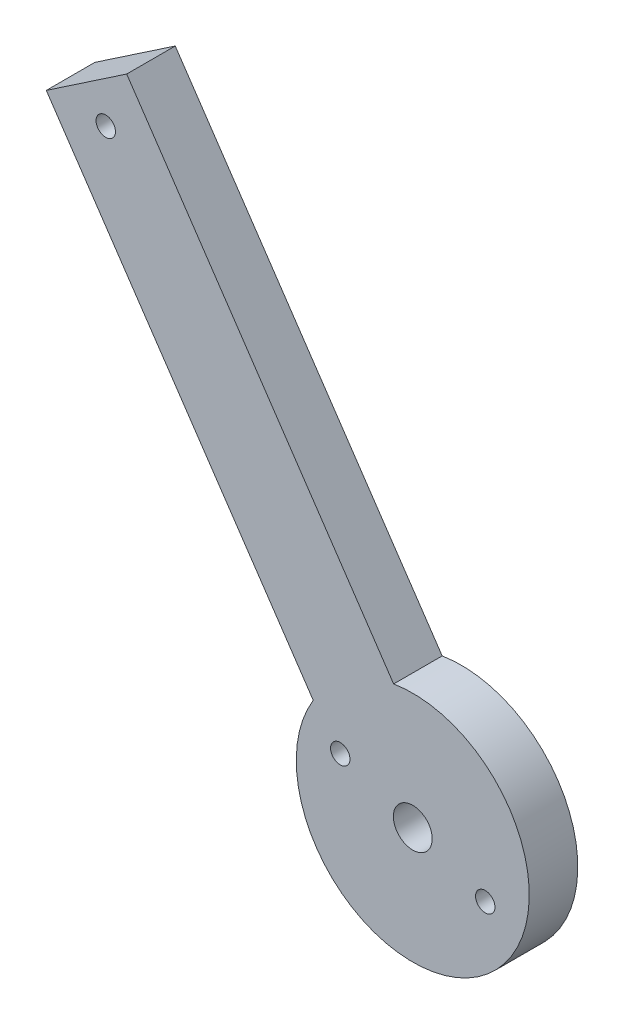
ISO-10303-21;
HEADER;
FILE_DESCRIPTION(('STEP AP214'),'2;1');
FILE_NAME('part.step','',(''),(''),'','','');
FILE_SCHEMA(('AUTOMOTIVE_DESIGN { 1 0 10303 214 1 1 1 1 }'));
ENDSEC;
DATA;
#1=APPLICATION_CONTEXT('core data for automotive mechanical design processes');
#2=APPLICATION_PROTOCOL_DEFINITION('international standard','automotive_design',2000,#1);
#3=PRODUCT_CONTEXT('',#1,'mechanical');
#4=PRODUCT('Part','Part','',(#3));
#5=PRODUCT_RELATED_PRODUCT_CATEGORY('part','',(#4));
#6=PRODUCT_DEFINITION_FORMATION('','',#4);
#7=PRODUCT_DEFINITION_CONTEXT('part definition',#1,'design');
#8=PRODUCT_DEFINITION('design','',#6,#7);
#9=PRODUCT_DEFINITION_SHAPE('','',#8);
#10=(LENGTH_UNIT() NAMED_UNIT(*) SI_UNIT(.MILLI.,.METRE.));
#11=(NAMED_UNIT(*) PLANE_ANGLE_UNIT() SI_UNIT($,.RADIAN.));
#12=(NAMED_UNIT(*) SI_UNIT($,.STERADIAN.) SOLID_ANGLE_UNIT());
#13=UNCERTAINTY_MEASURE_WITH_UNIT(LENGTH_MEASURE(1.E-05),#10,'distance_accuracy_value','');
#14=(GEOMETRIC_REPRESENTATION_CONTEXT(3) GLOBAL_UNCERTAINTY_ASSIGNED_CONTEXT((#13)) GLOBAL_UNIT_ASSIGNED_CONTEXT((#10,
#11,#12)) REPRESENTATION_CONTEXT('',''));
#15=CARTESIAN_POINT('',(0.,0.,0.));
#16=DIRECTION('',(0.,0.,1.));
#17=DIRECTION('',(1.,0.,0.));
#18=AXIS2_PLACEMENT_3D('',#15,#16,#17);
#19=CARTESIAN_POINT('',(0.,0.,5.));
#20=DIRECTION('',(0.,0.,-1.));
#21=DIRECTION('',(-1.,0.,0.));
#22=AXIS2_PLACEMENT_3D('',#19,#20,#21);
#23=CYLINDRICAL_SURFACE('',#22,12.);
#24=CARTESIAN_POINT('',(0.,0.,0.));
#25=DIRECTION('',(0.,0.,1.));
#26=DIRECTION('',(1.,0.,0.));
#27=AXIS2_PLACEMENT_3D('',#24,#25,#26);
#28=CIRCLE('',#27,12.);
#29=CARTESIAN_POINT('',(-10.2526700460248,6.23560397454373,0.));
#30=VERTEX_POINT('',#29);
#31=CARTESIAN_POINT('',(-1.96893679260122,11.8373682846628,0.));
#32=VERTEX_POINT('',#31);
#33=EDGE_CURVE('E96',#30,#32,#28,.T.);
#34=ORIENTED_EDGE('',*,*,#33,.T.);
#35=DIRECTION('',(0.,0.,-1.));
#36=VECTOR('',#35,1.);
#37=CARTESIAN_POINT('',(-1.96893679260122,11.8373682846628,5.));
#38=LINE('',#37,#36);
#39=CARTESIAN_POINT('',(-1.96893679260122,11.8373682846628,5.));
#40=VERTEX_POINT('',#39);
#41=EDGE_CURVE('E11',#40,#32,#38,.T.);
#42=ORIENTED_EDGE('',*,*,#41,.F.);
#43=CARTESIAN_POINT('',(0.,0.,5.));
#44=DIRECTION('',(0.,0.,1.));
#45=DIRECTION('',(1.,0.,0.));
#46=AXIS2_PLACEMENT_3D('',#43,#44,#45);
#47=CIRCLE('',#46,12.);
#48=CARTESIAN_POINT('',(-10.2526700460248,6.23560397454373,5.));
#49=VERTEX_POINT('',#48);
#50=EDGE_CURVE('E84',#49,#40,#47,.T.);
#51=ORIENTED_EDGE('',*,*,#50,.F.);
#52=DIRECTION('',(0.,0.,-1.));
#53=VECTOR('',#52,1.);
#54=CARTESIAN_POINT('',(-10.2526700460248,6.23560397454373,5.));
#55=LINE('',#54,#53);
#56=EDGE_CURVE('E92',#49,#30,#55,.T.);
#57=ORIENTED_EDGE('',*,*,#56,.T.);
#58=EDGE_LOOP('',(#34,#42,#51,#57));
#59=FACE_BOUND('',#58,.T.);
#60=ADVANCED_FACE('F33',(#59),#23,.T.);
#61=CARTESIAN_POINT('',(-29.4687192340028,52.5032816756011,5.));
#62=DIRECTION('',(-0.82837332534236,-0.56017643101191,0.));
#63=DIRECTION('',(0.56017643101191,-0.82837332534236,0.));
#64=AXIS2_PLACEMENT_3D('',#61,#62,#63);
#65=PLANE('',#64);
#66=DIRECTION('',(-0.56017643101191,0.82837332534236,0.));
#67=VECTOR('',#66,1.);
#68=CARTESIAN_POINT('',(-29.4687192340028,52.5032816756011,0.));
#69=LINE('',#68,#67);
#70=CARTESIAN_POINT('',(-29.4687192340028,52.5032816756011,0.));
#71=VERTEX_POINT('',#70);
#72=EDGE_CURVE('E88',#32,#71,#69,.T.);
#73=ORIENTED_EDGE('',*,*,#72,.T.);
#74=DIRECTION('',(0.,0.,-1.));
#75=VECTOR('',#74,1.);
#76=CARTESIAN_POINT('',(-29.4687192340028,52.5032816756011,5.));
#77=LINE('',#76,#75);
#78=CARTESIAN_POINT('',(-29.4687192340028,52.5032816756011,5.));
#79=VERTEX_POINT('',#78);
#80=EDGE_CURVE('E41',#79,#71,#77,.T.);
#81=ORIENTED_EDGE('',*,*,#80,.F.);
#82=DIRECTION('',(-0.56017643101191,0.82837332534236,0.));
#83=VECTOR('',#82,1.);
#84=CARTESIAN_POINT('',(-29.4687192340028,52.5032816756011,5.));
#85=LINE('',#84,#83);
#86=EDGE_CURVE('E79',#40,#79,#85,.T.);
#87=ORIENTED_EDGE('',*,*,#86,.F.);
#88=ORIENTED_EDGE('',*,*,#41,.T.);
#89=EDGE_LOOP('',(#73,#81,#87,#88));
#90=FACE_BOUND('',#89,.T.);
#91=ADVANCED_FACE('F87',(#90),#65,.F.);
#92=CARTESIAN_POINT('',(-37.7524524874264,46.9015173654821,5.));
#93=DIRECTION('',(0.56017643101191,-0.82837332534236,0.));
#94=DIRECTION('',(0.82837332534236,0.56017643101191,0.));
#95=AXIS2_PLACEMENT_3D('',#92,#93,#94);
#96=PLANE('',#95);
#97=DIRECTION('',(-0.82837332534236,-0.56017643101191,0.));
#98=VECTOR('',#97,1.);
#99=CARTESIAN_POINT('',(-37.7524524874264,46.9015173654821,0.));
#100=LINE('',#99,#98);
#101=CARTESIAN_POINT('',(-37.7524524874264,46.9015173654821,0.));
#102=VERTEX_POINT('',#101);
#103=EDGE_CURVE('E66',#71,#102,#100,.T.);
#104=ORIENTED_EDGE('',*,*,#103,.T.);
#105=DIRECTION('',(0.,0.,-1.));
#106=VECTOR('',#105,1.);
#107=CARTESIAN_POINT('',(-37.7524524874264,46.9015173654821,5.));
#108=LINE('',#107,#106);
#109=CARTESIAN_POINT('',(-37.7524524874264,46.9015173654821,5.));
#110=VERTEX_POINT('',#109);
#111=EDGE_CURVE('E89',#110,#102,#108,.T.);
#112=ORIENTED_EDGE('',*,*,#111,.F.);
#113=DIRECTION('',(-0.82837332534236,-0.56017643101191,0.));
#114=VECTOR('',#113,1.);
#115=CARTESIAN_POINT('',(-37.7524524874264,46.9015173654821,5.));
#116=LINE('',#115,#114);
#117=EDGE_CURVE('E82',#79,#110,#116,.T.);
#118=ORIENTED_EDGE('',*,*,#117,.F.);
#119=ORIENTED_EDGE('',*,*,#80,.T.);
#120=EDGE_LOOP('',(#104,#112,#118,#119));
#121=FACE_BOUND('',#120,.T.);
#122=ADVANCED_FACE('F90',(#121),#96,.F.);
#123=CARTESIAN_POINT('',(-10.2526700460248,6.23560397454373,5.));
#124=DIRECTION('',(0.82837332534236,0.56017643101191,0.));
#125=DIRECTION('',(-0.56017643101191,0.82837332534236,0.));
#126=AXIS2_PLACEMENT_3D('',#123,#124,#125);
#127=PLANE('',#126);
#128=DIRECTION('',(0.56017643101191,-0.82837332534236,0.));
#129=VECTOR('',#128,1.);
#130=CARTESIAN_POINT('',(-10.2526700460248,6.23560397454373,0.));
#131=LINE('',#130,#129);
#132=EDGE_CURVE('E72',#102,#30,#131,.T.);
#133=ORIENTED_EDGE('',*,*,#132,.T.);
#134=ORIENTED_EDGE('',*,*,#56,.F.);
#135=DIRECTION('',(0.56017643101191,-0.82837332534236,0.));
#136=VECTOR('',#135,1.);
#137=CARTESIAN_POINT('',(-10.2526700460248,6.23560397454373,5.));
#138=LINE('',#137,#136);
#139=EDGE_CURVE('E49',#110,#49,#138,.T.);
#140=ORIENTED_EDGE('',*,*,#139,.F.);
#141=ORIENTED_EDGE('',*,*,#111,.T.);
#142=EDGE_LOOP('',(#133,#134,#140,#141));
#143=FACE_BOUND('',#142,.T.);
#144=ADVANCED_FACE('F104',(#143),#127,.F.);
#145=CARTESIAN_POINT('',(0.,0.,5.));
#146=DIRECTION('',(0.,0.,1.));
#147=DIRECTION('',(1.,0.,0.));
#148=AXIS2_PLACEMENT_3D('',#145,#146,#147);
#149=PLANE('',#148);
#150=CARTESIAN_POINT('',(-7.46864341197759,2.86694359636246,5.));
#151=DIRECTION('',(0.,0.,1.));
#152=DIRECTION('',(1.,0.,0.));
#153=AXIS2_PLACEMENT_3D('',#150,#151,#152);
#154=CIRCLE('',#153,1.);
#155=CARTESIAN_POINT('',(-6.46864341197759,2.86694359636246,5.));
#156=VERTEX_POINT('',#155);
#157=EDGE_CURVE('E128',#156,#156,#154,.T.);
#158=ORIENTED_EDGE('',*,*,#157,.F.);
#159=EDGE_LOOP('',(#158));
#160=FACE_BOUND('',#159,.T.);
#161=CARTESIAN_POINT('',(7.46864341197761,-2.86694359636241,5.));
#162=DIRECTION('',(0.,0.,1.));
#163=DIRECTION('',(1.,0.,0.));
#164=AXIS2_PLACEMENT_3D('',#161,#162,#163);
#165=CIRCLE('',#164,1.);
#166=CARTESIAN_POINT('',(8.46864341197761,-2.86694359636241,5.));
#167=VERTEX_POINT('',#166);
#168=EDGE_CURVE('E122',#167,#167,#165,.T.);
#169=ORIENTED_EDGE('',*,*,#168,.F.);
#170=EDGE_LOOP('',(#169));
#171=FACE_BOUND('',#170,.T.);
#172=CARTESIAN_POINT('',(-31.6292418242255,46.7724430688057,5.));
#173=DIRECTION('',(0.,0.,1.));
#174=DIRECTION('',(1.,0.,0.));
#175=AXIS2_PLACEMENT_3D('',#172,#173,#174);
#176=CIRCLE('',#175,1.);
#177=CARTESIAN_POINT('',(-30.6292418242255,46.7724430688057,5.));
#178=VERTEX_POINT('',#177);
#179=EDGE_CURVE('E116',#178,#178,#176,.T.);
#180=ORIENTED_EDGE('',*,*,#179,.F.);
#181=EDGE_LOOP('',(#180));
#182=FACE_BOUND('',#181,.T.);
#183=CARTESIAN_POINT('',(0.,0.,5.));
#184=DIRECTION('',(0.,0.,1.));
#185=DIRECTION('',(1.,0.,0.));
#186=AXIS2_PLACEMENT_3D('',#183,#184,#185);
#187=CIRCLE('',#186,2.);
#188=CARTESIAN_POINT('',(2.,0.,5.));
#189=VERTEX_POINT('',#188);
#190=EDGE_CURVE('E110',#189,#189,#187,.T.);
#191=ORIENTED_EDGE('',*,*,#190,.F.);
#192=EDGE_LOOP('',(#191));
#193=FACE_BOUND('',#192,.T.);
#194=ORIENTED_EDGE('',*,*,#50,.T.);
#195=ORIENTED_EDGE('',*,*,#86,.T.);
#196=ORIENTED_EDGE('',*,*,#117,.T.);
#197=ORIENTED_EDGE('',*,*,#139,.T.);
#198=EDGE_LOOP('',(#194,#195,#196,#197));
#199=FACE_BOUND('',#198,.T.);
#200=ADVANCED_FACE('F80',(#160,#171,#182,#193,#199),#149,.T.);
#201=CARTESIAN_POINT('',(0.,0.,0.));
#202=DIRECTION('',(0.,0.,1.));
#203=DIRECTION('',(1.,0.,0.));
#204=AXIS2_PLACEMENT_3D('',#201,#202,#203);
#205=PLANE('',#204);
#206=CARTESIAN_POINT('',(-7.46864341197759,2.86694359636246,0.));
#207=DIRECTION('',(0.,0.,1.));
#208=DIRECTION('',(1.,0.,0.));
#209=AXIS2_PLACEMENT_3D('',#206,#207,#208);
#210=CIRCLE('',#209,1.);
#211=CARTESIAN_POINT('',(-6.46864341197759,2.86694359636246,0.));
#212=VERTEX_POINT('',#211);
#213=EDGE_CURVE('E125',#212,#212,#210,.T.);
#214=ORIENTED_EDGE('',*,*,#213,.T.);
#215=EDGE_LOOP('',(#214));
#216=FACE_BOUND('',#215,.T.);
#217=CARTESIAN_POINT('',(7.46864341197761,-2.86694359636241,0.));
#218=DIRECTION('',(0.,0.,1.));
#219=DIRECTION('',(1.,0.,0.));
#220=AXIS2_PLACEMENT_3D('',#217,#218,#219);
#221=CIRCLE('',#220,1.);
#222=CARTESIAN_POINT('',(8.46864341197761,-2.86694359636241,0.));
#223=VERTEX_POINT('',#222);
#224=EDGE_CURVE('E119',#223,#223,#221,.T.);
#225=ORIENTED_EDGE('',*,*,#224,.T.);
#226=EDGE_LOOP('',(#225));
#227=FACE_BOUND('',#226,.T.);
#228=CARTESIAN_POINT('',(-31.6292418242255,46.7724430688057,0.));
#229=DIRECTION('',(0.,0.,1.));
#230=DIRECTION('',(1.,0.,0.));
#231=AXIS2_PLACEMENT_3D('',#228,#229,#230);
#232=CIRCLE('',#231,1.);
#233=CARTESIAN_POINT('',(-30.6292418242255,46.7724430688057,0.));
#234=VERTEX_POINT('',#233);
#235=EDGE_CURVE('E113',#234,#234,#232,.T.);
#236=ORIENTED_EDGE('',*,*,#235,.T.);
#237=EDGE_LOOP('',(#236));
#238=FACE_BOUND('',#237,.T.);
#239=CARTESIAN_POINT('',(0.,0.,0.));
#240=DIRECTION('',(0.,0.,1.));
#241=DIRECTION('',(1.,0.,0.));
#242=AXIS2_PLACEMENT_3D('',#239,#240,#241);
#243=CIRCLE('',#242,2.);
#244=CARTESIAN_POINT('',(2.,0.,0.));
#245=VERTEX_POINT('',#244);
#246=EDGE_CURVE('E99',#245,#245,#243,.T.);
#247=ORIENTED_EDGE('',*,*,#246,.T.);
#248=EDGE_LOOP('',(#247));
#249=FACE_BOUND('',#248,.T.);
#250=ORIENTED_EDGE('',*,*,#33,.F.);
#251=ORIENTED_EDGE('',*,*,#132,.F.);
#252=ORIENTED_EDGE('',*,*,#103,.F.);
#253=ORIENTED_EDGE('',*,*,#72,.F.);
#254=EDGE_LOOP('',(#250,#251,#252,#253));
#255=FACE_BOUND('',#254,.T.);
#256=ADVANCED_FACE('F107',(#216,#227,#238,#249,#255),#205,.F.);
#257=CARTESIAN_POINT('',(0.,0.,0.));
#258=DIRECTION('',(0.,0.,1.));
#259=DIRECTION('',(1.,0.,0.));
#260=AXIS2_PLACEMENT_3D('',#257,#258,#259);
#261=CYLINDRICAL_SURFACE('',#260,2.);
#262=ORIENTED_EDGE('',*,*,#246,.F.);
#263=EDGE_LOOP('',(#262));
#264=FACE_BOUND('',#263,.T.);
#265=ORIENTED_EDGE('',*,*,#190,.T.);
#266=EDGE_LOOP('',(#265));
#267=FACE_BOUND('',#266,.T.);
#268=ADVANCED_FACE('F152',(#264,#267),#261,.F.);
#269=CARTESIAN_POINT('',(-31.6292418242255,46.7724430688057,0.));
#270=DIRECTION('',(0.,0.,1.));
#271=DIRECTION('',(1.,0.,0.));
#272=AXIS2_PLACEMENT_3D('',#269,#270,#271);
#273=CYLINDRICAL_SURFACE('',#272,1.);
#274=ORIENTED_EDGE('',*,*,#235,.F.);
#275=EDGE_LOOP('',(#274));
#276=FACE_BOUND('',#275,.T.);
#277=ORIENTED_EDGE('',*,*,#179,.T.);
#278=EDGE_LOOP('',(#277));
#279=FACE_BOUND('',#278,.T.);
#280=ADVANCED_FACE('F154',(#276,#279),#273,.F.);
#281=CARTESIAN_POINT('',(7.46864341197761,-2.86694359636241,0.));
#282=DIRECTION('',(0.,0.,1.));
#283=DIRECTION('',(1.,0.,0.));
#284=AXIS2_PLACEMENT_3D('',#281,#282,#283);
#285=CYLINDRICAL_SURFACE('',#284,1.);
#286=ORIENTED_EDGE('',*,*,#224,.F.);
#287=EDGE_LOOP('',(#286));
#288=FACE_BOUND('',#287,.T.);
#289=ORIENTED_EDGE('',*,*,#168,.T.);
#290=EDGE_LOOP('',(#289));
#291=FACE_BOUND('',#290,.T.);
#292=ADVANCED_FACE('F139',(#288,#291),#285,.F.);
#293=CARTESIAN_POINT('',(-7.46864341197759,2.86694359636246,0.));
#294=DIRECTION('',(0.,0.,1.));
#295=DIRECTION('',(1.,0.,0.));
#296=AXIS2_PLACEMENT_3D('',#293,#294,#295);
#297=CYLINDRICAL_SURFACE('',#296,1.);
#298=ORIENTED_EDGE('',*,*,#213,.F.);
#299=EDGE_LOOP('',(#298));
#300=FACE_BOUND('',#299,.T.);
#301=ORIENTED_EDGE('',*,*,#157,.T.);
#302=EDGE_LOOP('',(#301));
#303=FACE_BOUND('',#302,.T.);
#304=ADVANCED_FACE('F136',(#300,#303),#297,.F.);
#305=CLOSED_SHELL('',(#60,#91,#122,#144,#200,#256,#268,#280,#292,#304));
#306=MANIFOLD_SOLID_BREP('B2',#305);
#307=ADVANCED_BREP_SHAPE_REPRESENTATION('',(#18,#306),#14);
#308=SHAPE_DEFINITION_REPRESENTATION(#9,#307);
ENDSEC;
END-ISO-10303-21;
